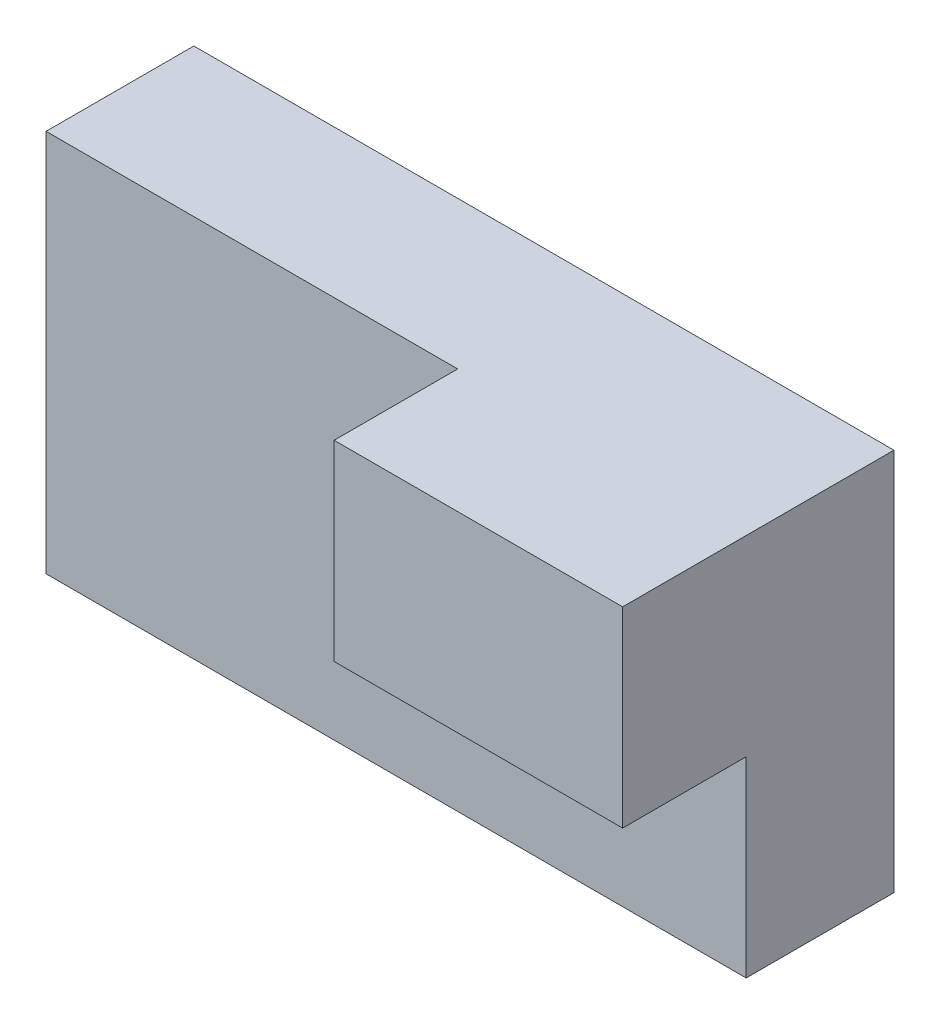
from build123d import *

# Parameters (mm, degrees)
SKETCH1_W           = 170.024730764
SKETCH1_H           = 93.066714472
EXTRUDE1_DEPTH      = 35.886761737
BOSS_EXTRUDE1_START = 110.88676
SKETCH3_W           = 70.061914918
SKETCH3_H           = 46.533357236
BOSS_EXTRUDE1_DEPTH = 30


with BuildPart() as part:
    # Sketch1 → Extrude1 (new body)
    with BuildSketch(Plane.XY):
        Rectangle(SKETCH1_W, SKETCH1_H)
    extrude(amount=EXTRUDE1_DEPTH)

    # Sketch3 → Boss-Extrude1 (add)
    with BuildSketch(Plane.XY.offset(-75).offset(BOSS_EXTRUDE1_START)):
        with Locations((49.981407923, 23.266678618)):
            Rectangle(SKETCH3_W, SKETCH3_H)
    extrude(amount=BOSS_EXTRUDE1_DEPTH)


solid = part.part
